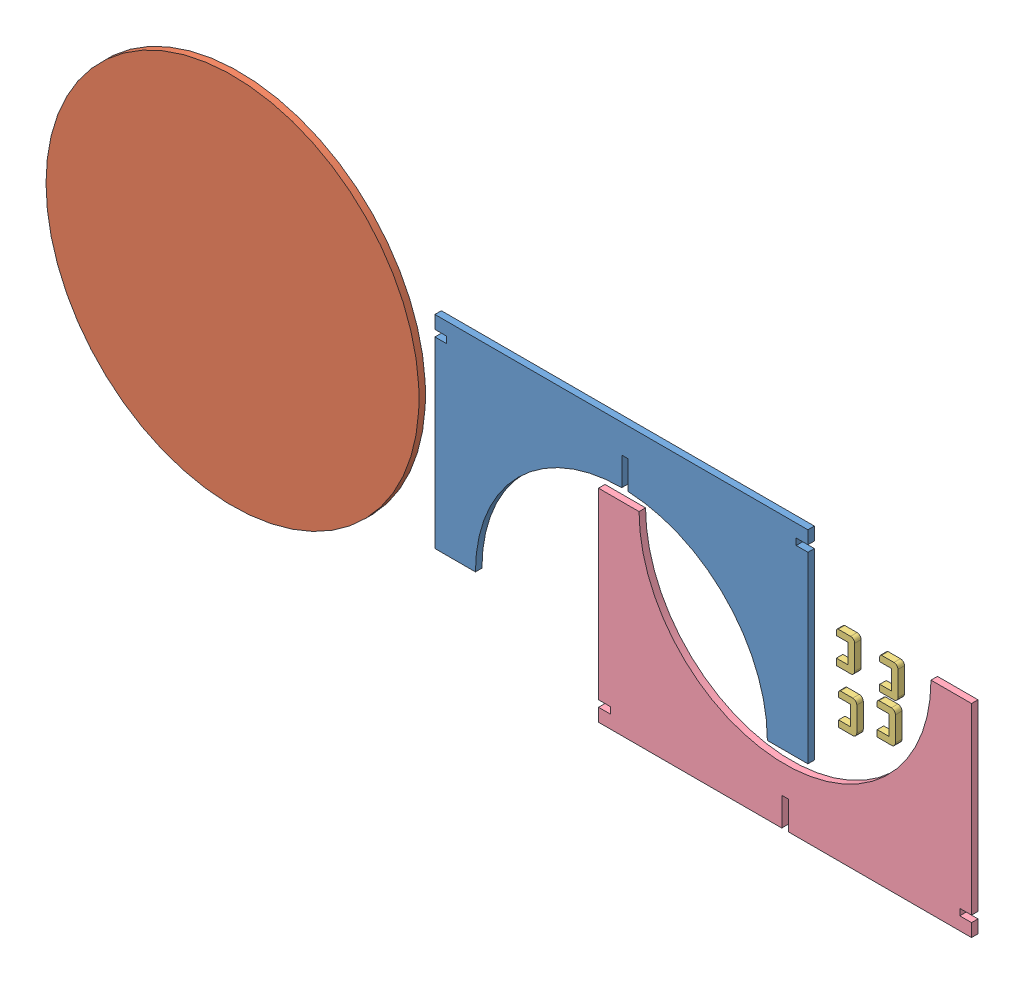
SolidWorks assembly drawing.DXF.SLDASM, configuration Default (file format 9000). Lengths in mm.
Overall size (2282.7 930.36 16).
7 component instances, 4 part files, 6 mates.
Components (placement in the parent):
- Part1-1: Part1.SLDPRT [Default] at (-897.35 -3.4012 1087.8046) x (-1 0 0) z (0 0 -1) size (920 500 16)
- part3-1: part3.SLDPRT [Default] at (-1643.893 151.4685 1087.8046) x (0 -1 0) z (1 0 0) size (920 16 920)
- part4-1: part4.SLDPRT [Default] at (-150.6511 15.0583 1071.8046) size (45 80.09 16)
- part4-2: part4.SLDPRT [Default] at (-155.9865 144.3312 1071.8046) size (45 80.09 16)
- part4-3: part4.SLDPRT [Default] at (-55.3116 41.9755 1071.8046) size (45 80.09 16)
- part4-4: part4.SLDPRT [Default] at (-49.0157 142.005 1071.8046) size (45 80.09 16)
- Part2-1: Part2.SLDPRT [Default] at (-250.2717 -178.8875 1071.8046) x (-1 0 0) z (0 0 1) size (920 500 16)
Mates (geometry in assembly coordinates):
- Coincident1: coincident aligned: plane of Part1-1 through (-684.7075 -149.1848 1087.8046) normal (0 0 1); plane of part3-1 through (-1643.893 151.4685 1087.8046) normal (0 0 1)
- Coincident2: coincident aligned: plane of Part1-1 through (-684.7075 -149.1848 1087.8046) normal (0 0 1); plane of Part2-1 through (-250.2717 -178.8875 1087.8046) normal (0 0 1)
- Coincident3: coincident aligned: plane of Part1-1 through (-684.7075 -149.1848 1087.8046) normal (0 0 1); plane of part4-1 through (-150.6511 15.0583 1087.8046) normal (0 0 1)
- Coincident4: coincident aligned: plane of Part1-1 through (-684.7075 -149.1848 1087.8046) normal (0 0 1); plane of part4-2 through (-155.9865 144.3312 1087.8046) normal (0 0 1)
- Coincident6: coincident aligned: plane of Part1-1 through (-684.7075 -149.1848 1087.8046) normal (0 0 1); plane of part4-4 through (-49.0157 142.005 1087.8046) normal (0 0 1)
- Coincident7: coincident aligned: plane of Part1-1 through (-684.7075 -149.1848 1087.8046) normal (0 0 1); plane of part4-3 through (-55.3116 41.9755 1087.8046) normal (0 0 1)
